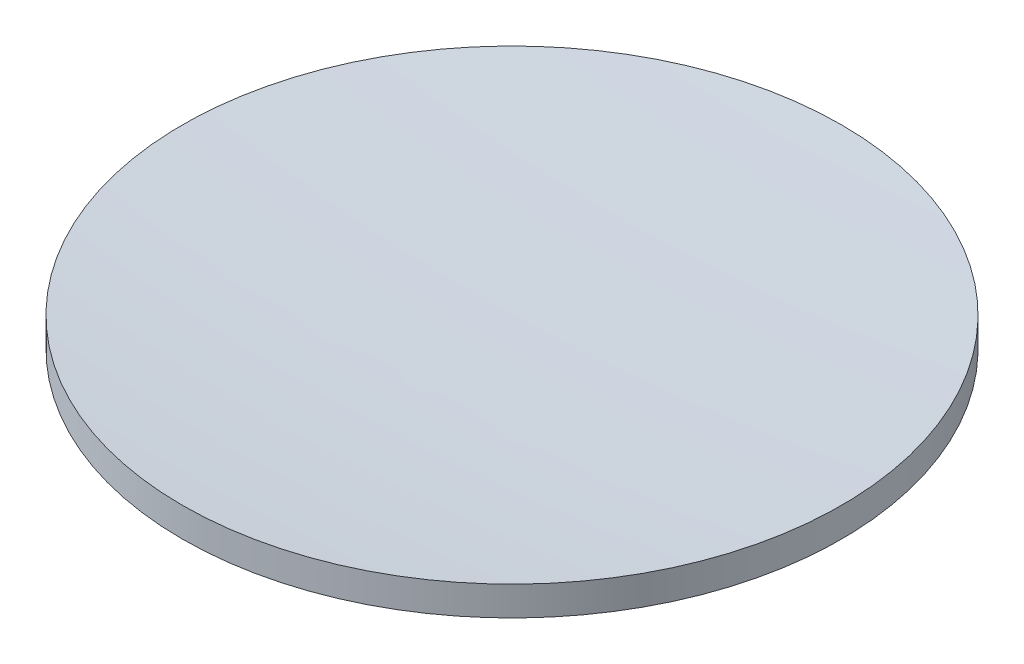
from build123d import *

# Parameters (mm, degrees)
SKETCH1_R      = 28.575
EXTRUDE1_DEPTH = 2.54


with BuildPart() as part:
    # Sketch1 → Extrude1 (new body)
    with BuildSketch(Plane(origin=(0, 0, 0), x_dir=(1, 0, 0), z_dir=(0, 1, 0))):
        with Locations(Location((0, 0, 0), (0, 0, 270))):
            Circle(SKETCH1_R)
    extrude(amount=EXTRUDE1_DEPTH)

    # Sketch2 → Cut-Revolve1 (revolve, cut)
    with BuildSketch(Plane(origin=(0, 0, 0), x_dir=(0, 0, -1), z_dir=(1, 0, 0)), mode=Mode.PRIVATE) as cut_revolve1_sk:
        with BuildLine():
            Line((0, 1.397), (0, 2.54))
            Line((0, 2.54), (-28.575, 2.54))
            ThreePointArc((-28.575, 2.54), (-14.298925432, 1.682864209), (0, 1.397))
        make_face()
    revolve(cut_revolve1_sk.sketch.rotate(Axis((0, 0, 0), (0, 1, 0)), 180), axis=Axis((0, 0, 0), (0, 1, 0)), mode=Mode.SUBTRACT)


solid = part.part
